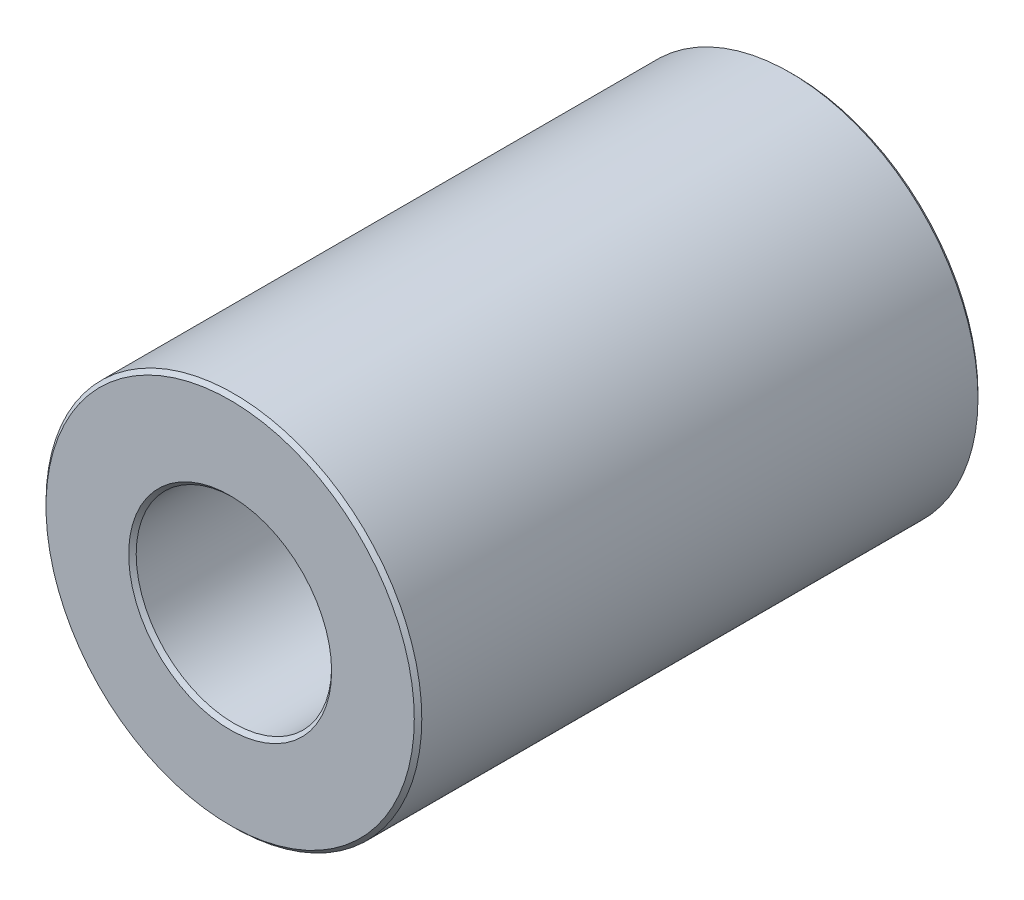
from build123d import *

# Parameters (mm, degrees)
SKETCH1_R           = 5
SKETCH1_R_2         = 2.6
BOSS_EXTRUDE2_DEPTH = 7.5
CHAMFER3_SIZE       = 0.1


with BuildPart() as part:
    # Sketch1 → Boss-Extrude2 (new, symmetric)
    with BuildSketch(Plane.XY):
        Circle(SKETCH1_R)
        Circle(SKETCH1_R_2, mode=Mode.SUBTRACT)
    extrude(amount=BOSS_EXTRUDE2_DEPTH, both=True)

    # Chamfer3
    chamfer3_edges = [part.edges().sort_by_distance(p)[0] for p in [
        (-5, 0, -7.5),
        (-5, 0, 7.5),
        (-2.6, 0, -7.5),
        (-2.6, 0, 7.5),
    ]]
    chamfer(chamfer3_edges, length=CHAMFER3_SIZE)


solid = part.part
